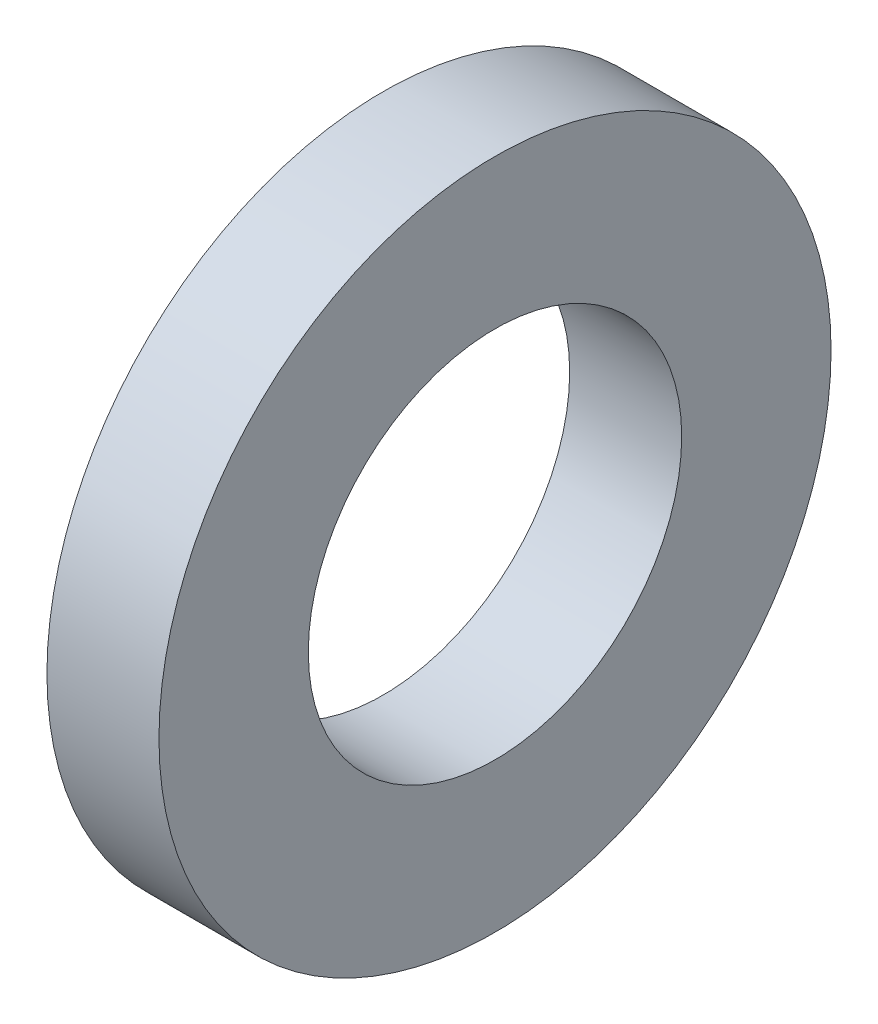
ISO-10303-21;
HEADER;
FILE_DESCRIPTION(('STEP AP214'),'2;1');
FILE_NAME('part.step','',(''),(''),'','','');
FILE_SCHEMA(('AUTOMOTIVE_DESIGN { 1 0 10303 214 1 1 1 1 }'));
ENDSEC;
DATA;
#1=APPLICATION_CONTEXT('core data for automotive mechanical design processes');
#2=APPLICATION_PROTOCOL_DEFINITION('international standard','automotive_design',2000,#1);
#3=PRODUCT_CONTEXT('',#1,'mechanical');
#4=PRODUCT('Part','Part','',(#3));
#5=PRODUCT_RELATED_PRODUCT_CATEGORY('part','',(#4));
#6=PRODUCT_DEFINITION_FORMATION('','',#4);
#7=PRODUCT_DEFINITION_CONTEXT('part definition',#1,'design');
#8=PRODUCT_DEFINITION('design','',#6,#7);
#9=PRODUCT_DEFINITION_SHAPE('','',#8);
#10=(LENGTH_UNIT() NAMED_UNIT(*) SI_UNIT(.MILLI.,.METRE.));
#11=(NAMED_UNIT(*) PLANE_ANGLE_UNIT() SI_UNIT($,.RADIAN.));
#12=(NAMED_UNIT(*) SI_UNIT($,.STERADIAN.) SOLID_ANGLE_UNIT());
#13=UNCERTAINTY_MEASURE_WITH_UNIT(LENGTH_MEASURE(1.E-05),#10,'distance_accuracy_value','');
#14=(GEOMETRIC_REPRESENTATION_CONTEXT(3) GLOBAL_UNCERTAINTY_ASSIGNED_CONTEXT((#13)) GLOBAL_UNIT_ASSIGNED_CONTEXT((#10,
#11,#12)) REPRESENTATION_CONTEXT('',''));
#15=CARTESIAN_POINT('',(0.,0.,0.));
#16=DIRECTION('',(0.,0.,1.));
#17=DIRECTION('',(1.,0.,0.));
#18=AXIS2_PLACEMENT_3D('',#15,#16,#17);
#19=CARTESIAN_POINT('',(3.,0.,0.));
#20=DIRECTION('',(1.,0.,0.));
#21=DIRECTION('',(0.,0.,-1.));
#22=AXIS2_PLACEMENT_3D('',#19,#20,#21);
#23=PLANE('',#22);
#24=CARTESIAN_POINT('',(3.,0.,0.));
#25=DIRECTION('',(1.,0.,0.));
#26=DIRECTION('',(0.,0.,-1.));
#27=AXIS2_PLACEMENT_3D('',#24,#25,#26);
#28=CIRCLE('',#27,9.);
#29=CARTESIAN_POINT('',(3.,0.,-9.));
#30=VERTEX_POINT('',#29);
#31=EDGE_CURVE('E10',#30,#30,#28,.T.);
#32=ORIENTED_EDGE('',*,*,#31,.T.);
#33=EDGE_LOOP('',(#32));
#34=FACE_BOUND('',#33,.T.);
#35=CARTESIAN_POINT('',(3.,0.,0.));
#36=DIRECTION('',(1.,0.,0.));
#37=DIRECTION('',(0.,0.,-1.));
#38=AXIS2_PLACEMENT_3D('',#35,#36,#37);
#39=CIRCLE('',#38,5.);
#40=CARTESIAN_POINT('',(3.,0.,-5.));
#41=VERTEX_POINT('',#40);
#42=EDGE_CURVE('E33',#41,#41,#39,.T.);
#43=ORIENTED_EDGE('',*,*,#42,.F.);
#44=EDGE_LOOP('',(#43));
#45=FACE_BOUND('',#44,.T.);
#46=ADVANCED_FACE('F22',(#34,#45),#23,.T.);
#47=CARTESIAN_POINT('',(0.,0.,0.));
#48=DIRECTION('',(1.,0.,0.));
#49=DIRECTION('',(0.,0.,-1.));
#50=AXIS2_PLACEMENT_3D('',#47,#48,#49);
#51=PLANE('',#50);
#52=CARTESIAN_POINT('',(0.,0.,0.));
#53=DIRECTION('',(1.,0.,0.));
#54=DIRECTION('',(0.,0.,-1.));
#55=AXIS2_PLACEMENT_3D('',#52,#53,#54);
#56=CIRCLE('',#55,9.);
#57=CARTESIAN_POINT('',(0.,0.,-9.));
#58=VERTEX_POINT('',#57);
#59=EDGE_CURVE('E29',#58,#58,#56,.T.);
#60=ORIENTED_EDGE('',*,*,#59,.F.);
#61=EDGE_LOOP('',(#60));
#62=FACE_BOUND('',#61,.T.);
#63=CARTESIAN_POINT('',(0.,0.,0.));
#64=DIRECTION('',(1.,0.,0.));
#65=DIRECTION('',(0.,0.,-1.));
#66=AXIS2_PLACEMENT_3D('',#63,#64,#65);
#67=CIRCLE('',#66,5.);
#68=CARTESIAN_POINT('',(0.,0.,-5.));
#69=VERTEX_POINT('',#68);
#70=EDGE_CURVE('E37',#69,#69,#67,.T.);
#71=ORIENTED_EDGE('',*,*,#70,.T.);
#72=EDGE_LOOP('',(#71));
#73=FACE_BOUND('',#72,.T.);
#74=ADVANCED_FACE('F43',(#62,#73),#51,.F.);
#75=CARTESIAN_POINT('',(3.,0.,0.));
#76=DIRECTION('',(-1.,0.,0.));
#77=DIRECTION('',(0.,0.,1.));
#78=AXIS2_PLACEMENT_3D('',#75,#76,#77);
#79=CYLINDRICAL_SURFACE('',#78,9.);
#80=ORIENTED_EDGE('',*,*,#31,.F.);
#81=EDGE_LOOP('',(#80));
#82=FACE_BOUND('',#81,.T.);
#83=ORIENTED_EDGE('',*,*,#59,.T.);
#84=EDGE_LOOP('',(#83));
#85=FACE_BOUND('',#84,.T.);
#86=ADVANCED_FACE('F24',(#82,#85),#79,.T.);
#87=CARTESIAN_POINT('',(3.,0.,0.));
#88=DIRECTION('',(-1.,0.,0.));
#89=DIRECTION('',(0.,0.,1.));
#90=AXIS2_PLACEMENT_3D('',#87,#88,#89);
#91=CYLINDRICAL_SURFACE('',#90,5.);
#92=ORIENTED_EDGE('',*,*,#42,.T.);
#93=EDGE_LOOP('',(#92));
#94=FACE_BOUND('',#93,.T.);
#95=ORIENTED_EDGE('',*,*,#70,.F.);
#96=EDGE_LOOP('',(#95));
#97=FACE_BOUND('',#96,.T.);
#98=ADVANCED_FACE('F45',(#94,#97),#91,.F.);
#99=CLOSED_SHELL('',(#46,#74,#86,#98));
#100=MANIFOLD_SOLID_BREP('B2',#99);
#101=ADVANCED_BREP_SHAPE_REPRESENTATION('',(#18,#100),#14);
#102=SHAPE_DEFINITION_REPRESENTATION(#9,#101);
ENDSEC;
END-ISO-10303-21;
